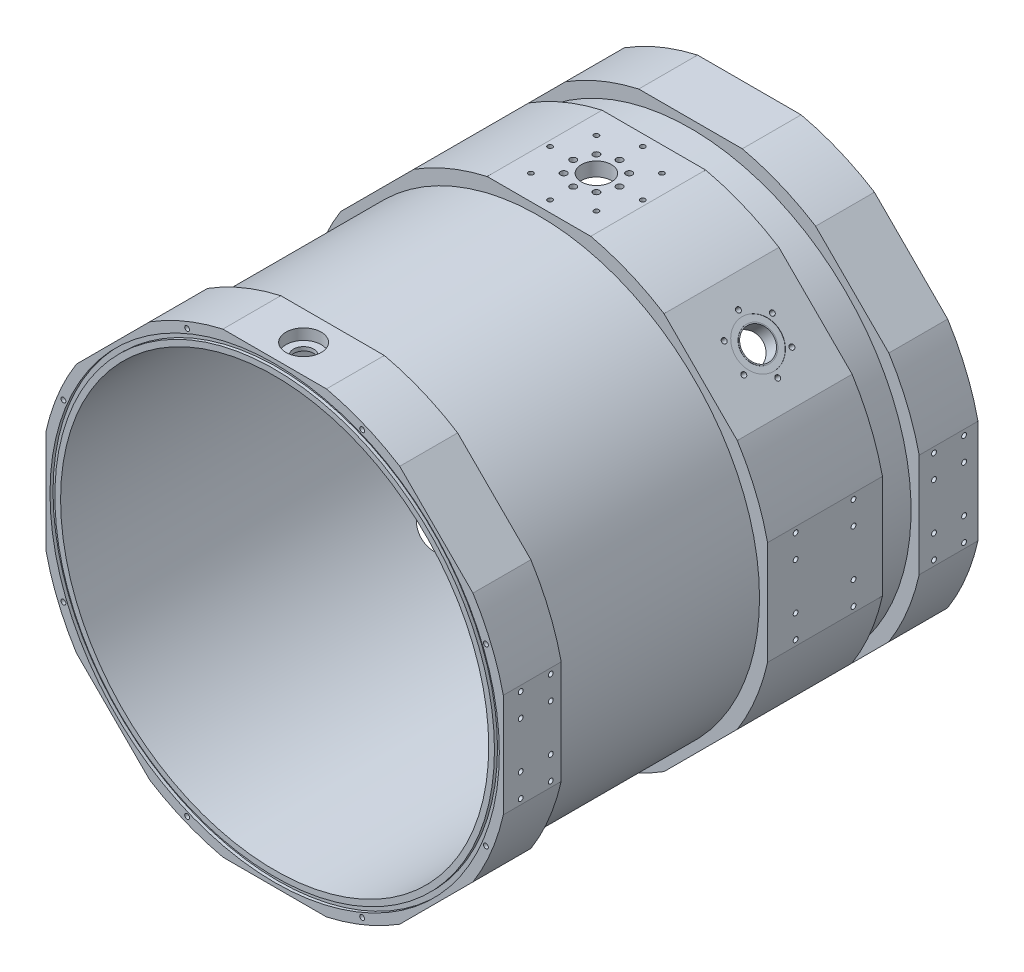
from build123d import *

# Parameters (mm, degrees)
SKETCH1_R                               = 202.5
SKETCH1_R_2                             = 184.9
BOSS_EXTRUDE1_DEPTH                     = 205
SKETCH3_OUTSIDE_W                       = 547.876
SKETCH3_OUTSIDE_H                       = 547.876
CUT_EXTRUDE1_DEPTH                      = 490
BOSS_EXTRUDE2_START                     = 15
SKETCH9_R                               = 184.9
SKETCH9_R_2                             = 171.9
BOSS_EXTRUDE2_DEPTH                     = 15
SKETCH11_OUTSIDE_W                      = 535.586
SKETCH11_OUTSIDE_H                      = 535.586
SKETCH11_OUTSIDE_R                      = 190.5
CUT_EXTRUDE7_DEPTH                      = 178.28926
SKETCH13_OUTSIDE_W                      = 535.586
SKETCH13_OUTSIDE_H                      = 535.586
SKETCH13_OUTSIDE_R                      = 190.5
CUT_EXTRUDE9_DEPTH                      = 31.71074
SKETCH20_R                              = 13
CUT_EXTRUDE10_DEPTH                     = 15
SKETCH21_R                              = 19.304
SKETCH21_R_2                            = 13.97
CUT_EXTRUDE11_DEPTH                     = 0.254
M5X0_8_TAPPED_HOLE6_AT_2_COUNT          = 2
M5X0_8_TAPPED_HOLE6_AT_2_PITCH          = 41.574415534
M5X0_8_TAPPED_HOLE6_AT_3_COUNT          = 2
M5X0_8_TAPPED_HOLE6_AT_3_PITCH          = 24.003
M5X0_8_TAPPED_HOLE6_AT_4_COUNT          = 2
M5X0_8_TAPPED_HOLE6_AT_4_PITCH          = 48.006
M5X0_8_TAPPED_HOLE6_AT_5_COUNT          = 2
M5X0_8_TAPPED_HOLE6_AT_5_PITCH          = 41.574415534
M5X0_8_TAPPED_HOLE6_AT_6_COUNT          = 2
M5X0_8_TAPPED_HOLE6_AT_6_PITCH          = 24.003
SKETCH24_R                              = 20.5
CUT_EXTRUDE12_DEPTH                     = 17
SKETCH25_R                              = 27.104
SKETCH25_R_2                            = 21.77
CUT_EXTRUDE13_DEPTH                     = 0.254
M5X0_8_TAPPED_HOLE7_AT_2_COUNT          = 2
M5X0_8_TAPPED_HOLE7_AT_2_PITCH          = 53.672790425
M5X0_8_TAPPED_HOLE7_AT_3_COUNT          = 2
M5X0_8_TAPPED_HOLE7_AT_3_PITCH          = 30.988
M5X0_8_TAPPED_HOLE7_AT_4_COUNT          = 2
M5X0_8_TAPPED_HOLE7_AT_4_PITCH          = 61.976
M5X0_8_TAPPED_HOLE7_AT_5_COUNT          = 2
M5X0_8_TAPPED_HOLE7_AT_5_PITCH          = 30.988
M5X0_8_TAPPED_HOLE7_AT_6_COUNT          = 2
M5X0_8_TAPPED_HOLE7_AT_6_PITCH          = 53.672790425
M5X0_8_TAPPED_HOLE2_AT_2_COUNT          = 2
M5X0_8_TAPPED_HOLE2_AT_2_PITCH          = 80
M5X0_8_TAPPED_HOLE2_AT_3_COUNT          = 2
M5X0_8_TAPPED_HOLE2_AT_3_PITCH          = 26
M5X0_8_TAPPED_HOLE2_AT_4_COUNT          = 2
M5X0_8_TAPPED_HOLE2_AT_4_PITCH          = 95.51074
M5X0_8_TAPPED_HOLE2_AT_5_COUNT          = 2
M5X0_8_TAPPED_HOLE2_AT_5_PITCH          = 124.588528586
M5X0_8_TAPPED_HOLE2_AT_6_COUNT          = 2
M5X0_8_TAPPED_HOLE2_AT_6_PITCH          = 145.51074
M5X0_8_TAPPED_HOLE2_AT_7_COUNT          = 2
M5X0_8_TAPPED_HOLE2_AT_7_PITCH          = 365.853795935
M5X0_8_TAPPED_HOLE2_AT_8_COUNT          = 2
M5X0_8_TAPPED_HOLE2_AT_8_PITCH          = 383
M5X0_8_TAPPED_HOLE2_AT_9_COUNT          = 2
M5X0_8_TAPPED_HOLE2_AT_9_PITCH          = 97.582280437
M5X0_8_TAPPED_HOLE2_AT_10_COUNT         = 2
M5X0_8_TAPPED_HOLE2_AT_10_PITCH         = 112.793180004
M5X0_8_TAPPED_HOLE2_AT_11_COUNT         = 2
M5X0_8_TAPPED_HOLE2_AT_11_PITCH         = 157.395601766
M5X0_8_TAPPED_HOLE2_AT_12_COUNT         = 2
M5X0_8_TAPPED_HOLE2_AT_12_PITCH         = 146.878778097
M5X0_8_TAPPED_HOLE2_AT_13_COUNT         = 2
M5X0_8_TAPPED_HOLE2_AT_13_PITCH         = 32.802438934
M5X0_8_TAPPED_HOLE2_AT_14_COUNT         = 2
M5X0_8_TAPPED_HOLE2_AT_14_PITCH         = 20
M5X0_8_TAPPED_HOLE2_AT_15_COUNT         = 2
M5X0_8_TAPPED_HOLE2_AT_15_PITCH         = 60
M5X0_8_TAPPED_HOLE2_AT_16_COUNT         = 2
M5X0_8_TAPPED_HOLE2_AT_16_PITCH         = 65.391130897
M5X0_8_TAPPED_HOLE2_AT_17_COUNT         = 2
M5X0_8_TAPPED_HOLE2_AT_17_PITCH         = 362.006906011
M5X0_8_TAPPED_HOLE2_AT_18_COUNT         = 2
M5X0_8_TAPPED_HOLE2_AT_18_PITCH         = 387.671252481
M5X0_8_TAPPED_HOLE2_AT_19_COUNT         = 2
M5X0_8_TAPPED_HOLE2_AT_19_PITCH         = 383.521837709
M5X0_8_TAPPED_HOLE2_AT_20_COUNT         = 2
M5X0_8_TAPPED_HOLE2_AT_20_PITCH         = 357.559785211
M5X0_8_TAPPED_HOLE2_AT_21_COUNT         = 2
M5X0_8_TAPPED_HOLE2_AT_21_PITCH         = 84.118963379
M5X0_8_TAPPED_HOLE2_AT_22_COUNT         = 2
M5X0_8_TAPPED_HOLE2_AT_22_PITCH         = 357
M5X0_8_TAPPED_HOLE2_AT_23_COUNT         = 2
M5X0_8_TAPPED_HOLE2_AT_23_PITCH         = 391.265894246
M5X0_8_TAPPED_HOLE2_AT_24_COUNT         = 2
M5X0_8_TAPPED_HOLE2_AT_24_PITCH         = 166.052327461
SKETCH31_R                              = 20.5
CUT_EXTRUDE14_DEPTH                     = 17
SKETCH33_R                              = 27.104
SKETCH33_R_2                            = 21.77
CUT_EXTRUDE15_DEPTH                     = 0.254
M5X0_8_TAPPED_HOLE8_D                   = 4.2
M5X0_8_TAPPED_HOLE8_DEPTH               = 6.4
M5X0_8_TAPPED_HOLE8_TIP                 = 1.2618073
SKETCH36_R                              = 31.75
CUT_EXTRUDE16_DEPTH                     = 20
CBORE_FOR_M5_HEX_HEAD_BOLT1_D           = 5.3
CBORE_FOR_M5_HEX_HEAD_BOLT1_CBORE_D     = 12.24
CBORE_FOR_M5_HEX_HEAD_BOLT1_CBORE_DEPTH = 3.58
CIRPATTERN4_COUNT                       = 16
CIRPATTERN5_COUNT                       = 8
CIRPATTERN6_COUNT                       = 8
O_RING_GROOVE_R                         = 194.056
O_RING_GROOVE_R_2                       = 189.865
CUT_EXTRUDE17_DEPTH                     = 2.6162
M25_CLEARANCE_HOLE5_D                   = 26
M25_CLEARANCE_HOLE5_DEPTH               = 25.4
M25_CLEARANCE_HOLE5_TIP                 = 7.811188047
CIRPATTERN11_COUNT                      = 8
SKETCH61_R                              = 8.7249
CUT_EXTRUDE18_DEPTH                     = 20
SKETCH62_R                              = 182.118
CUT_EXTRUDE19_DEPTH                     = 0.762
SKETCH63_R                              = 15.24
CUT_EXTRUDE20_DEPTH                     = 9.398


with BuildPart() as part:
    # Sketch1 → Boss-Extrude1 (new, symmetric)
    with BuildSketch(Plane.XY):
        with Locations(Location((0, 0, 0), (0, 0, 180))):
            Circle(SKETCH1_R)
        with Locations(Location((0, 0, 0), (0, 0, 180))):
            Circle(SKETCH1_R_2, mode=Mode.SUBTRACT)
    extrude(amount=BOSS_EXTRUDE1_DEPTH, both=True)

    # Sketch3 outside → Cut-Extrude1 (cut)
    with BuildSketch(Plane.XY.offset(205)):
        Rectangle(SKETCH3_OUTSIDE_W, SKETCH3_OUTSIDE_H)
        with BuildLine():
            Line((-44.72135955, 197.5), (44.72135955, 197.5))
            ThreePointArc((44.72135955, 197.5), (77.493395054, 187.085605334), (108.030812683, 171.276365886))
            Line((108.030812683, 171.276365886), (171.276365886, 108.030812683))
            ThreePointArc((171.276365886, 108.030812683), (187.085605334, 77.493395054), (197.5, 44.72135955))
            Line((197.5, 44.72135955), (197.5, -44.72135955))
            ThreePointArc((197.5, -44.72135955), (187.085605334, -77.493395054), (171.276365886, -108.030812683))
            Line((171.276365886, -108.030812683), (108.030812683, -171.276365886))
            ThreePointArc((108.030812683, -171.276365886), (77.493395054, -187.085605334), (44.72135955, -197.5))
            Line((44.72135955, -197.5), (-44.72135955, -197.5))
            ThreePointArc((-44.72135955, -197.5), (-77.493395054, -187.085605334), (-108.030812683, -171.276365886))
            Line((-108.030812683, -171.276365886), (-171.276365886, -108.030812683))
            ThreePointArc((-171.276365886, -108.030812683), (-187.085605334, -77.493395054), (-197.5, -44.72135955))
            Line((-197.5, -44.72135955), (-197.5, 44.72135955))
            ThreePointArc((-197.5, 44.72135955), (-187.085605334, 77.493395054), (-171.276365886, 108.030812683))
            Line((-171.276365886, 108.030812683), (-108.030812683, 171.276365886))
            ThreePointArc((-108.030812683, 171.276365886), (-77.493395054, 187.085605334), (-44.72135955, 197.5))
        make_face(mode=Mode.SUBTRACT)
    extrude(amount=-CUT_EXTRUDE1_DEPTH, mode=Mode.SUBTRACT)

    # Sketch9 → Boss-Extrude2 (add)
    with BuildSketch(Plane(origin=(0, 0, -179.65), x_dir=(-1, 0, 0), z_dir=(0, 0, -1)).offset(BOSS_EXTRUDE2_START)):
        Circle(SKETCH9_R)
        Circle(SKETCH9_R_2, mode=Mode.SUBTRACT)
    extrude(amount=-BOSS_EXTRUDE2_DEPTH)

    # Sketch11 outside → Cut-Extrude7 (cut)
    with BuildSketch(Plane.XY.offset(155)):
        Rectangle(SKETCH11_OUTSIDE_W, SKETCH11_OUTSIDE_H)
        Circle(SKETCH11_OUTSIDE_R, mode=Mode.SUBTRACT)
    extrude(amount=-CUT_EXTRUDE7_DEPTH, mode=Mode.SUBTRACT)

    # Sketch13 outside → Cut-Extrude9 (cut)
    with BuildSketch(Plane(origin=(0, 0, -154.2), x_dir=(-1, 0, 0), z_dir=(0, 0, -1))):
        Rectangle(SKETCH13_OUTSIDE_W, SKETCH13_OUTSIDE_H)
        with Locations(Location((0, 0, 0), (0, 0, 180))):
            Circle(SKETCH13_OUTSIDE_R, mode=Mode.SUBTRACT)
    extrude(amount=-CUT_EXTRUDE9_DEPTH, mode=Mode.SUBTRACT)

    # Sketch20 → Cut-Extrude10 (cut)
    with BuildSketch(Plane(origin=(-139.653589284, 139.653589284, 0), x_dir=(0, 0, 1), z_dir=(-0.7071067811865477, 0.7071067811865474, 0))):
        with Locations(Location((-72.88926, 0, 0), (0, 0, 270))):
            Circle(SKETCH20_R)
    cut_extrude10 = extrude(amount=-CUT_EXTRUDE10_DEPTH, mode=Mode.SUBTRACT)

    # Sketch21 → Cut-Extrude11 (cut)
    with BuildSketch(Plane(origin=(-139.653589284, 139.653589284, 0), x_dir=(0, 0, 1), z_dir=(-0.7071067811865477, 0.7071067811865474, 0))):
        with Locations(Location((-72.88926, 0, 0), (0, 0, 270))):
            Circle(SKETCH21_R)
        with Locations(Location((-72.88926, 0, 0), (0, 0, 270))):
            Circle(SKETCH21_R_2, mode=Mode.SUBTRACT)
    cut_extrude11 = extrude(amount=-CUT_EXTRUDE11_DEPTH, mode=Mode.SUBTRACT)

    # Sketch23 → M5x0.8 Tapped Hole6 (revolve, cut)
    with BuildSketch(Plane(origin=(-122.680905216, 156.626273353, -72.88926), x_dir=(-0.7071067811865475, -0.7071067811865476, 0), z_dir=(0, 0, 1))):
        Polygon((0, 0), (0, 8.3738073), (2.1, 7.112), (2.1, 0), align=None)
    m5x0_8_tapped_hole6 = revolve(axis=Axis((-127.171033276, 161.116401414, -72.88926), (0.7071067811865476, -0.7071067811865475, 0)), mode=Mode.SUBTRACT)

    # M5x0.8 Tapped Hole6 at 2: M5x0.8 Tapped Hole6 ×2
    with Locations(*[Vector(-0.6123724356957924, -0.6123724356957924, -0.5000000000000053) * (i * M5X0_8_TAPPED_HOLE6_AT_2_PITCH) for i in range(1, M5X0_8_TAPPED_HOLE6_AT_2_COUNT)]):
        add(m5x0_8_tapped_hole6, mode=Mode.SUBTRACT)

    # M5x0.8 Tapped Hole6 at 3: M5x0.8 Tapped Hole6 ×2
    with Locations(*[Vector(-0.3535533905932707, -0.3535533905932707, -0.8660254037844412) * (i * M5X0_8_TAPPED_HOLE6_AT_3_PITCH) for i in range(1, M5X0_8_TAPPED_HOLE6_AT_3_COUNT)]):
        add(m5x0_8_tapped_hole6, mode=Mode.SUBTRACT)

    # M5x0.8 Tapped Hole6 at 4: M5x0.8 Tapped Hole6 ×2
    with Locations(*[Vector(-0.7071067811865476, -0.7071067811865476, 0) * (i * M5X0_8_TAPPED_HOLE6_AT_4_PITCH) for i in range(1, M5X0_8_TAPPED_HOLE6_AT_4_COUNT)]):
        add(m5x0_8_tapped_hole6, mode=Mode.SUBTRACT)

    # M5x0.8 Tapped Hole6 at 5: M5x0.8 Tapped Hole6 ×2
    with Locations(*[Vector(-0.6123724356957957, -0.6123724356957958, 0.49999999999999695) * (i * M5X0_8_TAPPED_HOLE6_AT_5_PITCH) for i in range(1, M5X0_8_TAPPED_HOLE6_AT_5_COUNT)]):
        add(m5x0_8_tapped_hole6, mode=Mode.SUBTRACT)

    # M5x0.8 Tapped Hole6 at 6: M5x0.8 Tapped Hole6 ×2
    with Locations(*[Vector(-0.3535533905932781, -0.3535533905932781, 0.866025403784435) * (i * M5X0_8_TAPPED_HOLE6_AT_6_PITCH) for i in range(1, M5X0_8_TAPPED_HOLE6_AT_6_COUNT)]):
        add(m5x0_8_tapped_hole6, mode=Mode.SUBTRACT)

    # Mirror2: Cut-Extrude10, Cut-Extrude11, M5x0.8 Tapped Hole6 across plane
    add(cut_extrude10.mirror(Plane(origin=(0, 0, 0), x_dir=(0, 0, 1), z_dir=(1, 0, 0))), mode=Mode.SUBTRACT)
    add(cut_extrude11.mirror(Plane(origin=(0, 0, 0), x_dir=(0, 0, 1), z_dir=(1, 0, 0))), mode=Mode.SUBTRACT)
    add(m5x0_8_tapped_hole6.mirror(Plane(origin=(0, 0, 0), x_dir=(0, 0, 1), z_dir=(1, 0, 0))), mode=Mode.SUBTRACT)

    # Mirror2 copy 1 sketch → Mirror2 copy 1 (revolve, cut)
    with BuildSketch(Plane(origin=(148.139931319, 131.16724725, -93.676467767), x_dir=(0.7071067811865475, -0.7071067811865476, 0), z_dir=(0, 0, 1))):
        Polygon((0, 0), (0, -8.3738073), (2.1, -7.112), (2.1, 0), align=None)
    revolve(axis=Axis((152.630059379, 135.65737531, -93.676467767), (0.7071067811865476, 0.7071067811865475, 0)), mode=Mode.SUBTRACT)

    # Mirror2 copy 2 sketch → Mirror2 copy 2 (revolve, cut)
    with BuildSketch(Plane(origin=(131.16724725, 148.139931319, -93.676467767), x_dir=(0.7071067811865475, -0.7071067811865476, 0), z_dir=(0, 0, 1))):
        Polygon((0, 0), (0, -8.3738073), (2.1, -7.112), (2.1, 0), align=None)
    revolve(axis=Axis((135.65737531, 152.630059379, -93.676467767), (0.7071067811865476, 0.7071067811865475, 0)), mode=Mode.SUBTRACT)

    # Mirror2 copy 3 sketch → Mirror2 copy 3 (revolve, cut)
    with BuildSketch(Plane(origin=(156.626273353, 122.680905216, -72.88926), x_dir=(0.7071067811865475, -0.7071067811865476, 0), z_dir=(0, 0, 1))):
        Polygon((0, 0), (0, -8.3738073), (2.1, -7.112), (2.1, 0), align=None)
    revolve(axis=Axis((161.116401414, 127.171033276, -72.88926), (0.7071067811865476, 0.7071067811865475, 0)), mode=Mode.SUBTRACT)

    # Mirror2 copy 4 sketch → Mirror2 copy 4 (revolve, cut)
    with BuildSketch(Plane(origin=(148.139931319, 131.16724725, -52.102052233), x_dir=(0.7071067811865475, -0.7071067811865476, 0), z_dir=(0, 0, 1))):
        Polygon((0, 0), (0, -8.3738073), (2.1, -7.112), (2.1, 0), align=None)
    revolve(axis=Axis((152.630059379, 135.65737531, -52.102052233), (0.7071067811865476, 0.7071067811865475, 0)), mode=Mode.SUBTRACT)

    # Mirror2 copy 5 sketch → Mirror2 copy 5 (revolve, cut)
    with BuildSketch(Plane(origin=(131.16724725, 148.139931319, -52.102052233), x_dir=(0.7071067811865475, -0.7071067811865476, 0), z_dir=(0, 0, 1))):
        Polygon((0, 0), (0, -8.3738073), (2.1, -7.112), (2.1, 0), align=None)
    revolve(axis=Axis((135.65737531, 152.630059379, -52.102052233), (0.7071067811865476, 0.7071067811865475, 0)), mode=Mode.SUBTRACT)

    # Sketch24 → Cut-Extrude12 (cut)
    with BuildSketch(Plane(origin=(-139.653589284, -139.653589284, 0), x_dir=(0, 0, 1), z_dir=(0.7071067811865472, 0.7071067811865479, 0))):
        with Locations(Location((-72.88926, 0, 0), (0, 0, 90))):
            Circle(SKETCH24_R)
    cut_extrude12 = extrude(amount=CUT_EXTRUDE12_DEPTH, mode=Mode.SUBTRACT)

    # Sketch25 → Cut-Extrude13 (cut)
    with BuildSketch(Plane(origin=(-139.653589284, -139.653589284, 0), x_dir=(0, 0, 1), z_dir=(0.7071067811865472, 0.7071067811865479, 0))):
        with Locations(Location((-72.88926, 0, 0), (0, 0, 270))):
            Circle(SKETCH25_R)
        with Locations(Location((-72.88926, 0, 0), (0, 0, 270))):
            Circle(SKETCH25_R_2, mode=Mode.SUBTRACT)
    cut_extrude13 = extrude(amount=CUT_EXTRUDE13_DEPTH, mode=Mode.SUBTRACT)

    # Sketch28 → M5x0.8 Tapped Hole7 (revolve, cut)
    with BuildSketch(Plane(origin=(-161.56541422, -117.741764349, -72.88926), x_dir=(0.7071067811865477, -0.7071067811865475, 0), z_dir=(0, 0, 1))):
        Polygon((0, 0), (0, 7.6618073), (2.1, 6.4), (2.1, 0), align=None)
    m5x0_8_tapped_hole7 = revolve(axis=Axis((-166.05554228, -122.231892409, -72.88926), (0.7071067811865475, 0.7071067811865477, 0)), mode=Mode.SUBTRACT)

    # M5x0.8 Tapped Hole7 at 2: M5x0.8 Tapped Hole7 ×2
    with Locations(*[Vector(0.612372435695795, -0.6123724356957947, -0.49999999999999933) * (i * M5X0_8_TAPPED_HOLE7_AT_2_PITCH) for i in range(1, M5X0_8_TAPPED_HOLE7_AT_2_COUNT)]):
        add(m5x0_8_tapped_hole7, mode=Mode.SUBTRACT)

    # M5x0.8 Tapped Hole7 at 3: M5x0.8 Tapped Hole7 ×2
    with Locations(*[Vector(0.3535533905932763, -0.35355339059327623, -0.8660254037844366) * (i * M5X0_8_TAPPED_HOLE7_AT_3_PITCH) for i in range(1, M5X0_8_TAPPED_HOLE7_AT_3_COUNT)]):
        add(m5x0_8_tapped_hole7, mode=Mode.SUBTRACT)

    # M5x0.8 Tapped Hole7 at 4: M5x0.8 Tapped Hole7 ×2
    with Locations(*[Vector(0.7071067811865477, -0.7071067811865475, 0) * (i * M5X0_8_TAPPED_HOLE7_AT_4_PITCH) for i in range(1, M5X0_8_TAPPED_HOLE7_AT_4_COUNT)]):
        add(m5x0_8_tapped_hole7, mode=Mode.SUBTRACT)

    # M5x0.8 Tapped Hole7 at 5: M5x0.8 Tapped Hole7 ×2
    with Locations(*[Vector(0.35355339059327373, -0.3535533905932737, 0.8660254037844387) * (i * M5X0_8_TAPPED_HOLE7_AT_5_PITCH) for i in range(1, M5X0_8_TAPPED_HOLE7_AT_5_COUNT)]):
        add(m5x0_8_tapped_hole7, mode=Mode.SUBTRACT)

    # M5x0.8 Tapped Hole7 at 6: M5x0.8 Tapped Hole7 ×2
    with Locations(*[Vector(0.6123724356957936, -0.6123724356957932, 0.5000000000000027) * (i * M5X0_8_TAPPED_HOLE7_AT_6_PITCH) for i in range(1, M5X0_8_TAPPED_HOLE7_AT_6_COUNT)]):
        add(m5x0_8_tapped_hole7, mode=Mode.SUBTRACT)

    # Mirror4: Cut-Extrude12, Cut-Extrude13, M5x0.8 Tapped Hole7 across plane
    add(cut_extrude12.mirror(Plane(origin=(0, 0, 0), x_dir=(0, 0, 1), z_dir=(1, 0, 0))), mode=Mode.SUBTRACT)
    add(cut_extrude13.mirror(Plane(origin=(0, 0, 0), x_dir=(0, 0, 1), z_dir=(1, 0, 0))), mode=Mode.SUBTRACT)
    add(m5x0_8_tapped_hole7.mirror(Plane(origin=(0, 0, 0), x_dir=(0, 0, 1), z_dir=(1, 0, 0))), mode=Mode.SUBTRACT)

    # Mirror4 copy 1 sketch → Mirror4 copy 1 (revolve, cut)
    with BuildSketch(Plane(origin=(128.697676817, -150.609501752, -99.725655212), x_dir=(-0.7071067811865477, -0.7071067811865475, 0), z_dir=(0, 0, 1))):
        Polygon((0, 0), (0, -7.6618073), (2.1, -6.4), (2.1, 0), align=None)
    revolve(axis=Axis((133.187804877, -155.099629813, -99.725655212), (0.7071067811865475, -0.7071067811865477, 0)), mode=Mode.SUBTRACT)

    # Mirror4 copy 2 sketch → Mirror4 copy 2 (revolve, cut)
    with BuildSketch(Plane(origin=(150.609501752, -128.697676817, -99.725655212), x_dir=(-0.7071067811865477, -0.7071067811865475, 0), z_dir=(0, 0, 1))):
        Polygon((0, 0), (0, -7.6618073), (2.1, -6.4), (2.1, 0), align=None)
    revolve(axis=Axis((155.099629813, -133.187804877, -99.725655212), (0.7071067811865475, -0.7071067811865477, 0)), mode=Mode.SUBTRACT)

    # Mirror4 copy 3 sketch → Mirror4 copy 3 (revolve, cut)
    with BuildSketch(Plane(origin=(117.741764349, -161.56541422, -72.88926), x_dir=(-0.7071067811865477, -0.7071067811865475, 0), z_dir=(0, 0, 1))):
        Polygon((0, 0), (0, -7.6618073), (2.1, -6.4), (2.1, 0), align=None)
    revolve(axis=Axis((122.231892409, -166.05554228, -72.88926), (0.7071067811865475, -0.7071067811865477, 0)), mode=Mode.SUBTRACT)

    # Mirror4 copy 4 sketch → Mirror4 copy 4 (revolve, cut)
    with BuildSketch(Plane(origin=(150.609501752, -128.697676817, -46.052864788), x_dir=(-0.7071067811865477, -0.7071067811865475, 0), z_dir=(0, 0, 1))):
        Polygon((0, 0), (0, -7.6618073), (2.1, -6.4), (2.1, 0), align=None)
    revolve(axis=Axis((155.099629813, -133.187804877, -46.052864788), (0.7071067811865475, -0.7071067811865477, 0)), mode=Mode.SUBTRACT)

    # Mirror4 copy 5 sketch → Mirror4 copy 5 (revolve, cut)
    with BuildSketch(Plane(origin=(128.697676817, -150.609501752, -46.052864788), x_dir=(-0.7071067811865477, -0.7071067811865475, 0), z_dir=(0, 0, 1))):
        Polygon((0, 0), (0, -7.6618073), (2.1, -6.4), (2.1, 0), align=None)
    revolve(axis=Axis((133.187804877, -155.099629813, -46.052864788), (0.7071067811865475, -0.7071067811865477, 0)), mode=Mode.SUBTRACT)

    # Sketch30 → M5x0.8 Tapped Hole2 (revolve, cut)
    with BuildSketch(Plane(origin=(197.5, 40, -193), x_dir=(0, 0, -1), z_dir=(0, 1, 0))):
        Polygon((0, 0), (0, 9.3898073), (2.1, 8.128), (2.1, 0), align=None)
    m5x0_8_tapped_hole2 = revolve(axis=Axis((203.85, 40, -193), (-1, 0, 0)), mode=Mode.SUBTRACT)

    # M5x0.8 Tapped Hole2 at 2: M5x0.8 Tapped Hole2 ×2
    with Locations(*[(0, -i * M5X0_8_TAPPED_HOLE2_AT_2_PITCH, 0) for i in range(1, M5X0_8_TAPPED_HOLE2_AT_2_COUNT)]):
        add(m5x0_8_tapped_hole2, mode=Mode.SUBTRACT)

    # M5x0.8 Tapped Hole2 at 3: M5x0.8 Tapped Hole2 ×2
    with Locations(*[(0, 0, i * M5X0_8_TAPPED_HOLE2_AT_3_PITCH) for i in range(1, M5X0_8_TAPPED_HOLE2_AT_3_COUNT)]):
        add(m5x0_8_tapped_hole2, mode=Mode.SUBTRACT)

    # M5x0.8 Tapped Hole2 at 4: M5x0.8 Tapped Hole2 ×2
    with Locations(*[(0, 0, i * M5X0_8_TAPPED_HOLE2_AT_4_PITCH) for i in range(1, M5X0_8_TAPPED_HOLE2_AT_4_COUNT)]):
        add(m5x0_8_tapped_hole2, mode=Mode.SUBTRACT)

    # M5x0.8 Tapped Hole2 at 5: M5x0.8 Tapped Hole2 ×2
    with Locations(*[Vector(0, -0.6421136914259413, 0.7666094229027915) * (i * M5X0_8_TAPPED_HOLE2_AT_5_PITCH) for i in range(1, M5X0_8_TAPPED_HOLE2_AT_5_COUNT)]):
        add(m5x0_8_tapped_hole2, mode=Mode.SUBTRACT)

    # M5x0.8 Tapped Hole2 at 6: M5x0.8 Tapped Hole2 ×2
    with Locations(*[(0, 0, i * M5X0_8_TAPPED_HOLE2_AT_6_PITCH) for i in range(1, M5X0_8_TAPPED_HOLE2_AT_6_COUNT)]):
        add(m5x0_8_tapped_hole2, mode=Mode.SUBTRACT)

    # M5x0.8 Tapped Hole2 at 7: M5x0.8 Tapped Hole2 ×2
    with Locations(*[Vector(0, -0.2186665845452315, 0.9757996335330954) * (i * M5X0_8_TAPPED_HOLE2_AT_7_PITCH) for i in range(1, M5X0_8_TAPPED_HOLE2_AT_7_COUNT)]):
        add(m5x0_8_tapped_hole2, mode=Mode.SUBTRACT)

    # M5x0.8 Tapped Hole2 at 8: M5x0.8 Tapped Hole2 ×2
    with Locations(*[(0, 0, i * M5X0_8_TAPPED_HOLE2_AT_8_PITCH) for i in range(1, M5X0_8_TAPPED_HOLE2_AT_8_COUNT)]):
        add(m5x0_8_tapped_hole2, mode=Mode.SUBTRACT)

    # M5x0.8 Tapped Hole2 at 9: M5x0.8 Tapped Hole2 ×2
    with Locations(*[Vector(0, -0.2049552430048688, 0.9787713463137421) * (i * M5X0_8_TAPPED_HOLE2_AT_9_PITCH) for i in range(1, M5X0_8_TAPPED_HOLE2_AT_9_COUNT)]):
        add(m5x0_8_tapped_hole2, mode=Mode.SUBTRACT)

    # M5x0.8 Tapped Hole2 at 10: M5x0.8 Tapped Hole2 ×2
    with Locations(*[Vector(0, -0.5319470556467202, 0.8467776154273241) * (i * M5X0_8_TAPPED_HOLE2_AT_10_PITCH) for i in range(1, M5X0_8_TAPPED_HOLE2_AT_10_COUNT)]):
        add(m5x0_8_tapped_hole2, mode=Mode.SUBTRACT)

    # M5x0.8 Tapped Hole2 at 11: M5x0.8 Tapped Hole2 ×2
    with Locations(*[Vector(0, -0.3812050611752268, 0.9244905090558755) * (i * M5X0_8_TAPPED_HOLE2_AT_11_PITCH) for i in range(1, M5X0_8_TAPPED_HOLE2_AT_11_COUNT)]):
        add(m5x0_8_tapped_hole2, mode=Mode.SUBTRACT)

    # M5x0.8 Tapped Hole2 at 12: M5x0.8 Tapped Hole2 ×2
    with Locations(*[Vector(0, -0.1361667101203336, 0.9906859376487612) * (i * M5X0_8_TAPPED_HOLE2_AT_12_PITCH) for i in range(1, M5X0_8_TAPPED_HOLE2_AT_12_COUNT)]):
        add(m5x0_8_tapped_hole2, mode=Mode.SUBTRACT)

    # M5x0.8 Tapped Hole2 at 13: M5x0.8 Tapped Hole2 ×2
    with Locations(*[Vector(0, -0.6097107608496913, 0.7926239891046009) * (i * M5X0_8_TAPPED_HOLE2_AT_13_PITCH) for i in range(1, M5X0_8_TAPPED_HOLE2_AT_13_COUNT)]):
        add(m5x0_8_tapped_hole2, mode=Mode.SUBTRACT)

    # M5x0.8 Tapped Hole2 at 14: M5x0.8 Tapped Hole2 ×2
    with Locations(*[(0, -i * M5X0_8_TAPPED_HOLE2_AT_14_PITCH, 0) for i in range(1, M5X0_8_TAPPED_HOLE2_AT_14_COUNT)]):
        add(m5x0_8_tapped_hole2, mode=Mode.SUBTRACT)

    # M5x0.8 Tapped Hole2 at 15: M5x0.8 Tapped Hole2 ×2
    with Locations(*[(0, -i * M5X0_8_TAPPED_HOLE2_AT_15_PITCH, 0) for i in range(1, M5X0_8_TAPPED_HOLE2_AT_15_COUNT)]):
        add(m5x0_8_tapped_hole2, mode=Mode.SUBTRACT)

    # M5x0.8 Tapped Hole2 at 16: M5x0.8 Tapped Hole2 ×2
    with Locations(*[Vector(0, -0.9175556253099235, 0.39760743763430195) * (i * M5X0_8_TAPPED_HOLE2_AT_16_PITCH) for i in range(1, M5X0_8_TAPPED_HOLE2_AT_16_COUNT)]):
        add(m5x0_8_tapped_hole2, mode=Mode.SUBTRACT)

    # M5x0.8 Tapped Hole2 at 17: M5x0.8 Tapped Hole2 ×2
    with Locations(*[Vector(0, -0.16574269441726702, 0.9861690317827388) * (i * M5X0_8_TAPPED_HOLE2_AT_17_PITCH) for i in range(1, M5X0_8_TAPPED_HOLE2_AT_17_COUNT)]):
        add(m5x0_8_tapped_hole2, mode=Mode.SUBTRACT)

    # M5x0.8 Tapped Hole2 at 18: M5x0.8 Tapped Hole2 ×2
    with Locations(*[Vector(0, -0.15477031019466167, 0.9879504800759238) * (i * M5X0_8_TAPPED_HOLE2_AT_18_PITCH) for i in range(1, M5X0_8_TAPPED_HOLE2_AT_18_COUNT)]):
        add(m5x0_8_tapped_hole2, mode=Mode.SUBTRACT)

    # M5x0.8 Tapped Hole2 at 19: M5x0.8 Tapped Hole2 ×2
    with Locations(*[Vector(0, -0.052148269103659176, 0.9986393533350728) * (i * M5X0_8_TAPPED_HOLE2_AT_19_PITCH) for i in range(1, M5X0_8_TAPPED_HOLE2_AT_19_COUNT)]):
        add(m5x0_8_tapped_hole2, mode=Mode.SUBTRACT)

    # M5x0.8 Tapped Hole2 at 20: M5x0.8 Tapped Hole2 ×2
    with Locations(*[Vector(0, -0.05593470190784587, 0.9984344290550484) * (i * M5X0_8_TAPPED_HOLE2_AT_20_PITCH) for i in range(1, M5X0_8_TAPPED_HOLE2_AT_20_COUNT)]):
        add(m5x0_8_tapped_hole2, mode=Mode.SUBTRACT)

    # M5x0.8 Tapped Hole2 at 21: M5x0.8 Tapped Hole2 ×2
    with Locations(*[Vector(0, -0.9510340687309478, 0.30908607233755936) * (i * M5X0_8_TAPPED_HOLE2_AT_21_PITCH) for i in range(1, M5X0_8_TAPPED_HOLE2_AT_21_COUNT)]):
        add(m5x0_8_tapped_hole2, mode=Mode.SUBTRACT)

    # M5x0.8 Tapped Hole2 at 22: M5x0.8 Tapped Hole2 ×2
    with Locations(*[(0, 0, i * M5X0_8_TAPPED_HOLE2_AT_22_PITCH) for i in range(1, M5X0_8_TAPPED_HOLE2_AT_22_COUNT)]):
        add(m5x0_8_tapped_hole2, mode=Mode.SUBTRACT)

    # M5x0.8 Tapped Hole2 at 23: M5x0.8 Tapped Hole2 ×2
    with Locations(*[Vector(0, -0.20446453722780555, 0.9788739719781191) * (i * M5X0_8_TAPPED_HOLE2_AT_23_PITCH) for i in range(1, M5X0_8_TAPPED_HOLE2_AT_23_COUNT)]):
        add(m5x0_8_tapped_hole2, mode=Mode.SUBTRACT)

    # M5x0.8 Tapped Hole2 at 24: M5x0.8 Tapped Hole2 ×2
    with Locations(*[Vector(0, -0.48177584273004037, 0.8762944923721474) * (i * M5X0_8_TAPPED_HOLE2_AT_24_PITCH) for i in range(1, M5X0_8_TAPPED_HOLE2_AT_24_COUNT)]):
        add(m5x0_8_tapped_hole2, mode=Mode.SUBTRACT)

    # Sketch31 → Cut-Extrude14 (cut)
    with BuildSketch(Plane.XZ.offset(197.5)):
        with Locations(Location((0, -72.88926, 0), (0, 0, 270))):
            Circle(SKETCH31_R)
    extrude(amount=-CUT_EXTRUDE14_DEPTH, mode=Mode.SUBTRACT)

    # Sketch33 → Cut-Extrude15 (cut)
    with BuildSketch(Plane.XZ.offset(197.5)):
        with Locations(Location((0, -72.88926, 0), (0, 0, 270))):
            Circle(SKETCH33_R)
        with Locations(Location((0, -72.88926, 0), (0, 0, 270))):
            Circle(SKETCH33_R_2, mode=Mode.SUBTRACT)
    extrude(amount=-CUT_EXTRUDE15_DEPTH, mode=Mode.SUBTRACT)

    # M5x0.8 Tapped Hole8
    with Locations(Plane(origin=(-30.988, -197.5, -72.88926), x_dir=(0, 0, -1), z_dir=(0, -1, 0))):
        with Locations((0, 0), (26.836395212, 46.482), (26.836395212, 15.494), (0, 61.976), (-26.836395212, 15.494), (-26.836395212, 46.482)):
            Hole(M5X0_8_TAPPED_HOLE8_D / 2, depth=M5X0_8_TAPPED_HOLE8_DEPTH)
            with Locations((0, 0, -(M5X0_8_TAPPED_HOLE8_DEPTH + M5X0_8_TAPPED_HOLE8_TIP / 2))):  # 118° drill point
                Cone(0, M5X0_8_TAPPED_HOLE8_D / 2, M5X0_8_TAPPED_HOLE8_TIP, mode=Mode.SUBTRACT)

    # Sketch36 → Cut-Extrude16 (cut)
    with BuildSketch(Plane(origin=(0, 185.5, 0), x_dir=(-1, 0, 0), z_dir=(0, 1, 0))):
        with Locations(Location((0, -72.88926, 0), (0, 0, 90))):
            Circle(SKETCH36_R)
    extrude(amount=-CUT_EXTRUDE16_DEPTH, mode=Mode.SUBTRACT)

    # CBORE for M5 Hex Head Bolt1 (through all)
    with Locations(Plane(origin=(0, 176.9, -194.65), x_dir=(-1, 0, 0), z_dir=(0, 0, -1))):
        with Locations((0, 0)):
            cbore_for_m5_hex_head_bolt1 = CounterBoreHole(CBORE_FOR_M5_HEX_HEAD_BOLT1_D / 2, CBORE_FOR_M5_HEX_HEAD_BOLT1_CBORE_D / 2, CBORE_FOR_M5_HEX_HEAD_BOLT1_CBORE_DEPTH)

    # CirPattern4: CBORE for M5 Hex Head Bolt1 ×16 about axis
    cirpattern4_axis = Axis((0, 0, 0), (0, 0, 1))
    for i in range(1, CIRPATTERN4_COUNT):
        add(cbore_for_m5_hex_head_bolt1.rotate(cirpattern4_axis, i * 360 / CIRPATTERN4_COUNT), mode=Mode.SUBTRACT)

    # Sketch44 → M5x0.8 Tapped Hole4 (revolve, cut)
    with BuildSketch(Plane(origin=(75.579977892, 182.466207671, 205), x_dir=(0, -1, 0), z_dir=(1, 0, 0))):
        Polygon((0, 0), (0, 13.6618073), (2.1, 12.4), (2.1, 0), align=None)
    m5x0_8_tapped_hole4 = revolve(axis=Axis((75.579977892, 182.466207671, 211.35), (0, 0, -1)), mode=Mode.SUBTRACT)

    # CirPattern5: M5x0.8 Tapped Hole4 ×8 about axis
    cirpattern5_axis = Axis((0, 0, 0), (0, 0, 1))
    for i in range(1, CIRPATTERN5_COUNT):
        add(m5x0_8_tapped_hole4.rotate(cirpattern5_axis, i * 360 / CIRPATTERN5_COUNT), mode=Mode.SUBTRACT)

    # Sketch46 → M5x0.8 Tapped Hole3 (revolve, cut)
    with BuildSketch(Plane(origin=(-75.579977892, 182.466207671, -205), x_dir=(0, 1, 0), z_dir=(1, 0, 0))):
        Polygon((0, 0), (0, 13.6618073), (2.1, 12.4), (2.1, 0), align=None)
    m5x0_8_tapped_hole3 = revolve(axis=Axis((-75.579977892, 182.466207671, -211.35), (0, 0, 1)), mode=Mode.SUBTRACT)

    # CirPattern6: M5x0.8 Tapped Hole3 ×8 about axis
    cirpattern6_axis = Axis((0, 0, 0), (0, 0, 1))
    for i in range(1, CIRPATTERN6_COUNT):
        add(m5x0_8_tapped_hole3.rotate(cirpattern6_axis, i * 360 / CIRPATTERN6_COUNT), mode=Mode.SUBTRACT)

    # o_ring_groove → Cut-Extrude17 (cut)
    with BuildSketch(Plane.XY.offset(205)):
        Circle(O_RING_GROOVE_R)
        Circle(O_RING_GROOVE_R_2, mode=Mode.SUBTRACT)
    cut_extrude17 = extrude(amount=-CUT_EXTRUDE17_DEPTH, mode=Mode.SUBTRACT)

    # Mirror6: Cut-Extrude17 across plane
    add(cut_extrude17.mirror(Plane.XY), mode=Mode.SUBTRACT)

    # M25 Clearance Hole5
    with Locations(Plane(origin=(0, 197.5, -72.88926), x_dir=(0, 0, 1), z_dir=(0, 1, 0))):
        with Locations((0, 0)):
            Hole(M25_CLEARANCE_HOLE5_D / 2, depth=M25_CLEARANCE_HOLE5_DEPTH)
            with Locations((0, 0, -(M25_CLEARANCE_HOLE5_DEPTH + M25_CLEARANCE_HOLE5_TIP / 2))):  # 118° drill point
                Cone(0, M25_CLEARANCE_HOLE5_D / 2, M25_CLEARANCE_HOLE5_TIP, mode=Mode.SUBTRACT)

    # Sketch59 → M5 Clearance Hole1 (revolve, cut)
    with BuildSketch(Plane(origin=(-20, 197.5, -72.88926), x_dir=(0, 0, 1), z_dir=(1, 0, 0))):
        Polygon((0, 0), (0, 27.052366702), (2.75, 25.4), (2.75, 0), align=None)
    m5_clearance_hole1 = revolve(axis=Axis((-20, 203.85, -72.88926), (0, -1, 0)), mode=Mode.SUBTRACT)

    # Sketch60 → M5x0.8 Tapped Hole5 (revolve, cut)
    with BuildSketch(Plane(origin=(-40, 197.5, -72.88926), x_dir=(0, 0, 1), z_dir=(1, 0, 0))):
        Polygon((0, 0), (0, 8.3738073), (2.1, 7.112), (2.1, 0), align=None)
    m5x0_8_tapped_hole5 = revolve(axis=Axis((-40, 203.85, -72.88926), (0, -1, 0)), mode=Mode.SUBTRACT)

    # CirPattern11: M5 Clearance Hole1, M5x0.8 Tapped Hole5 ×8 about axis
    cirpattern11_axis = Axis((0, 0, -72.88926), (0, 1, 0))
    add([m5_clearance_hole1.rotate(cirpattern11_axis, i * 360 / CIRPATTERN11_COUNT) for i in range(1, CIRPATTERN11_COUNT)], mode=Mode.SUBTRACT)
    add([m5x0_8_tapped_hole5.rotate(cirpattern11_axis, i * 360 / CIRPATTERN11_COUNT) for i in range(1, CIRPATTERN11_COUNT)], mode=Mode.SUBTRACT)

    # Sketch61 → Cut-Extrude18 (cut)
    with BuildSketch(Plane(origin=(0, 197.5, 0), x_dir=(-1, 0, 0), z_dir=(0, 1, 0))):
        with Locations(Location((0, 180, 0), (0, 0, 90))):
            Circle(SKETCH61_R)
    extrude(amount=-CUT_EXTRUDE18_DEPTH, mode=Mode.SUBTRACT)

    # Sketch62 → Cut-Extrude19 (cut)
    with BuildSketch(Plane.XY.offset(-179.65)):
        Circle(SKETCH62_R)
    extrude(amount=-CUT_EXTRUDE19_DEPTH, mode=Mode.SUBTRACT)

    # Sketch63 → Cut-Extrude20 (cut)
    with BuildSketch(Plane(origin=(0, 197.5, 0), x_dir=(1, 0, 0), z_dir=(0, 1, 0))):
        with Locations(Location((0, -180, 0), (0, 0, 270))):
            Circle(SKETCH63_R)
    extrude(amount=-CUT_EXTRUDE20_DEPTH, mode=Mode.SUBTRACT)

    # Mirror7: M5x0.8 Tapped Hole2 across plane
    add(m5x0_8_tapped_hole2.mirror(Plane(origin=(0, 0, 0), x_dir=(0, 0, 1), z_dir=(1, 0, 0))), mode=Mode.SUBTRACT)

    # Mirror7 copy 1 sketch → Mirror7 copy 1 (revolve, cut)
    with BuildSketch(Plane(origin=(-197.5, -40, -193), x_dir=(0, 0, -1), z_dir=(0, 1, 0))):
        Polygon((0, 0), (0, -9.3898073), (2.1, -8.128), (2.1, 0), align=None)
    revolve(axis=Axis((-203.85, -40, -193), (-1, 0, 0)), mode=Mode.SUBTRACT)

    # Mirror7 copy 2 sketch → Mirror7 copy 2 (revolve, cut)
    with BuildSketch(Plane(origin=(-197.5, 40, -167), x_dir=(0, 0, -1), z_dir=(0, 1, 0))):
        Polygon((0, 0), (0, -9.3898073), (2.1, -8.128), (2.1, 0), align=None)
    revolve(axis=Axis((-203.85, 40, -167), (-1, 0, 0)), mode=Mode.SUBTRACT)

    # Mirror7 copy 3 sketch → Mirror7 copy 3 (revolve, cut)
    with BuildSketch(Plane(origin=(-197.5, 40, -97.48926), x_dir=(0, 0, -1), z_dir=(0, 1, 0))):
        Polygon((0, 0), (0, -9.3898073), (2.1, -8.128), (2.1, 0), align=None)
    revolve(axis=Axis((-203.85, 40, -97.48926), (-1, 0, 0)), mode=Mode.SUBTRACT)

    # Mirror7 copy 4 sketch → Mirror7 copy 4 (revolve, cut)
    with BuildSketch(Plane(origin=(-197.5, -40, -97.48926), x_dir=(0, 0, -1), z_dir=(0, 1, 0))):
        Polygon((0, 0), (0, -9.3898073), (2.1, -8.128), (2.1, 0), align=None)
    revolve(axis=Axis((-203.85, -40, -97.48926), (-1, 0, 0)), mode=Mode.SUBTRACT)

    # Mirror7 copy 5 sketch → Mirror7 copy 5 (revolve, cut)
    with BuildSketch(Plane(origin=(-197.5, 40, -47.48926), x_dir=(0, 0, -1), z_dir=(0, 1, 0))):
        Polygon((0, 0), (0, -9.3898073), (2.1, -8.128), (2.1, 0), align=None)
    revolve(axis=Axis((-203.85, 40, -47.48926), (-1, 0, 0)), mode=Mode.SUBTRACT)

    # Mirror7 copy 6 sketch → Mirror7 copy 6 (revolve, cut)
    with BuildSketch(Plane(origin=(-197.5, -40, 164), x_dir=(0, 0, -1), z_dir=(0, 1, 0))):
        Polygon((0, 0), (0, -9.3898073), (2.1, -8.128), (2.1, 0), align=None)
    revolve(axis=Axis((-203.85, -40, 164), (-1, 0, 0)), mode=Mode.SUBTRACT)

    # Mirror7 copy 7 sketch → Mirror7 copy 7 (revolve, cut)
    with BuildSketch(Plane(origin=(-197.5, 40, 190), x_dir=(0, 0, -1), z_dir=(0, 1, 0))):
        Polygon((0, 0), (0, -9.3898073), (2.1, -8.128), (2.1, 0), align=None)
    revolve(axis=Axis((-203.85, 40, 190), (-1, 0, 0)), mode=Mode.SUBTRACT)

    # Mirror7 copy 8 sketch → Mirror7 copy 8 (revolve, cut)
    with BuildSketch(Plane(origin=(-197.5, 20, -97.48926), x_dir=(0, 0, -1), z_dir=(0, 1, 0))):
        Polygon((0, 0), (0, -9.3898073), (2.1, -8.128), (2.1, 0), align=None)
    revolve(axis=Axis((-203.85, 20, -97.48926), (-1, 0, 0)), mode=Mode.SUBTRACT)

    # Mirror7 copy 9 sketch → Mirror7 copy 9 (revolve, cut)
    with BuildSketch(Plane(origin=(-197.5, -20, -97.48926), x_dir=(0, 0, -1), z_dir=(0, 1, 0))):
        Polygon((0, 0), (0, -9.3898073), (2.1, -8.128), (2.1, 0), align=None)
    revolve(axis=Axis((-203.85, -20, -97.48926), (-1, 0, 0)), mode=Mode.SUBTRACT)

    # Mirror7 copy 10 sketch → Mirror7 copy 10 (revolve, cut)
    with BuildSketch(Plane(origin=(-197.5, -20, -47.48926), x_dir=(0, 0, -1), z_dir=(0, 1, 0))):
        Polygon((0, 0), (0, -9.3898073), (2.1, -8.128), (2.1, 0), align=None)
    revolve(axis=Axis((-203.85, -20, -47.48926), (-1, 0, 0)), mode=Mode.SUBTRACT)

    # Mirror7 copy 11 sketch → Mirror7 copy 11 (revolve, cut)
    with BuildSketch(Plane(origin=(-197.5, 20, -47.48926), x_dir=(0, 0, -1), z_dir=(0, 1, 0))):
        Polygon((0, 0), (0, -9.3898073), (2.1, -8.128), (2.1, 0), align=None)
    revolve(axis=Axis((-203.85, 20, -47.48926), (-1, 0, 0)), mode=Mode.SUBTRACT)

    # Mirror7 copy 12 sketch → Mirror7 copy 12 (revolve, cut)
    with BuildSketch(Plane(origin=(-197.5, 20, -167), x_dir=(0, 0, -1), z_dir=(0, 1, 0))):
        Polygon((0, 0), (0, -9.3898073), (2.1, -8.128), (2.1, 0), align=None)
    revolve(axis=Axis((-203.85, 20, -167), (-1, 0, 0)), mode=Mode.SUBTRACT)

    # Mirror7 copy 13 sketch → Mirror7 copy 13 (revolve, cut)
    with BuildSketch(Plane(origin=(-197.5, 20, -193), x_dir=(0, 0, -1), z_dir=(0, 1, 0))):
        Polygon((0, 0), (0, -9.3898073), (2.1, -8.128), (2.1, 0), align=None)
    revolve(axis=Axis((-203.85, 20, -193), (-1, 0, 0)), mode=Mode.SUBTRACT)

    # Mirror7 copy 14 sketch → Mirror7 copy 14 (revolve, cut)
    with BuildSketch(Plane(origin=(-197.5, -20, -193), x_dir=(0, 0, -1), z_dir=(0, 1, 0))):
        Polygon((0, 0), (0, -9.3898073), (2.1, -8.128), (2.1, 0), align=None)
    revolve(axis=Axis((-203.85, -20, -193), (-1, 0, 0)), mode=Mode.SUBTRACT)

    # Mirror7 copy 15 sketch → Mirror7 copy 15 (revolve, cut)
    with BuildSketch(Plane(origin=(-197.5, -20, -167), x_dir=(0, 0, -1), z_dir=(0, 1, 0))):
        Polygon((0, 0), (0, -9.3898073), (2.1, -8.128), (2.1, 0), align=None)
    revolve(axis=Axis((-203.85, -20, -167), (-1, 0, 0)), mode=Mode.SUBTRACT)

    # Mirror7 copy 16 sketch → Mirror7 copy 16 (revolve, cut)
    with BuildSketch(Plane(origin=(-197.5, -20, 164), x_dir=(0, 0, -1), z_dir=(0, 1, 0))):
        Polygon((0, 0), (0, -9.3898073), (2.1, -8.128), (2.1, 0), align=None)
    revolve(axis=Axis((-203.85, -20, 164), (-1, 0, 0)), mode=Mode.SUBTRACT)

    # Mirror7 copy 17 sketch → Mirror7 copy 17 (revolve, cut)
    with BuildSketch(Plane(origin=(-197.5, -20, 190), x_dir=(0, 0, -1), z_dir=(0, 1, 0))):
        Polygon((0, 0), (0, -9.3898073), (2.1, -8.128), (2.1, 0), align=None)
    revolve(axis=Axis((-203.85, -20, 190), (-1, 0, 0)), mode=Mode.SUBTRACT)

    # Mirror7 copy 18 sketch → Mirror7 copy 18 (revolve, cut)
    with BuildSketch(Plane(origin=(-197.5, 20, 190), x_dir=(0, 0, -1), z_dir=(0, 1, 0))):
        Polygon((0, 0), (0, -9.3898073), (2.1, -8.128), (2.1, 0), align=None)
    revolve(axis=Axis((-203.85, 20, 190), (-1, 0, 0)), mode=Mode.SUBTRACT)

    # Mirror7 copy 19 sketch → Mirror7 copy 19 (revolve, cut)
    with BuildSketch(Plane(origin=(-197.5, 20, 164), x_dir=(0, 0, -1), z_dir=(0, 1, 0))):
        Polygon((0, 0), (0, -9.3898073), (2.1, -8.128), (2.1, 0), align=None)
    revolve(axis=Axis((-203.85, 20, 164), (-1, 0, 0)), mode=Mode.SUBTRACT)

    # Mirror7 copy 20 sketch → Mirror7 copy 20 (revolve, cut)
    with BuildSketch(Plane(origin=(-197.5, -40, -167), x_dir=(0, 0, -1), z_dir=(0, 1, 0))):
        Polygon((0, 0), (0, -9.3898073), (2.1, -8.128), (2.1, 0), align=None)
    revolve(axis=Axis((-203.85, -40, -167), (-1, 0, 0)), mode=Mode.SUBTRACT)

    # Mirror7 copy 21 sketch → Mirror7 copy 21 (revolve, cut)
    with BuildSketch(Plane(origin=(-197.5, 40, 164), x_dir=(0, 0, -1), z_dir=(0, 1, 0))):
        Polygon((0, 0), (0, -9.3898073), (2.1, -8.128), (2.1, 0), align=None)
    revolve(axis=Axis((-203.85, 40, 164), (-1, 0, 0)), mode=Mode.SUBTRACT)

    # Mirror7 copy 22 sketch → Mirror7 copy 22 (revolve, cut)
    with BuildSketch(Plane(origin=(-197.5, -40, 190), x_dir=(0, 0, -1), z_dir=(0, 1, 0))):
        Polygon((0, 0), (0, -9.3898073), (2.1, -8.128), (2.1, 0), align=None)
    revolve(axis=Axis((-203.85, -40, 190), (-1, 0, 0)), mode=Mode.SUBTRACT)

    # Mirror7 copy 23 sketch → Mirror7 copy 23 (revolve, cut)
    with BuildSketch(Plane(origin=(-197.5, -40, -47.48926), x_dir=(0, 0, -1), z_dir=(0, 1, 0))):
        Polygon((0, 0), (0, -9.3898073), (2.1, -8.128), (2.1, 0), align=None)
    revolve(axis=Axis((-203.85, -40, -47.48926), (-1, 0, 0)), mode=Mode.SUBTRACT)


solid = part.part
